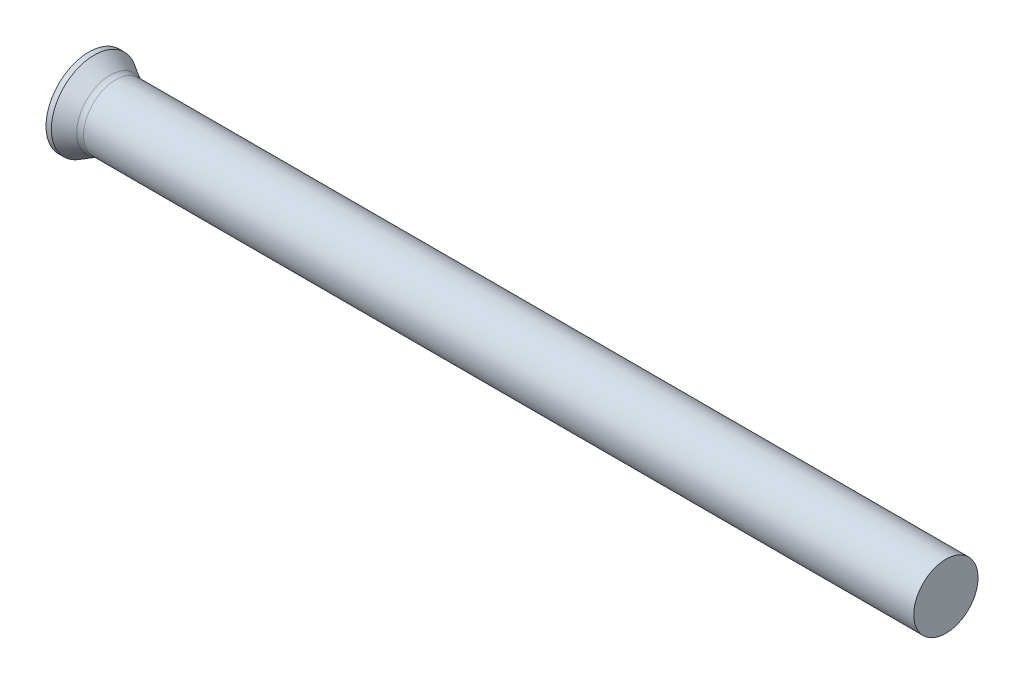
ISO-10303-21;
HEADER;
FILE_DESCRIPTION(('STEP AP214'),'2;1');
FILE_NAME('part.step','',(''),(''),'','','');
FILE_SCHEMA(('AUTOMOTIVE_DESIGN { 1 0 10303 214 1 1 1 1 }'));
ENDSEC;
DATA;
#1=APPLICATION_CONTEXT('core data for automotive mechanical design processes');
#2=APPLICATION_PROTOCOL_DEFINITION('international standard','automotive_design',2000,#1);
#3=PRODUCT_CONTEXT('',#1,'mechanical');
#4=PRODUCT('Part','Part','',(#3));
#5=PRODUCT_RELATED_PRODUCT_CATEGORY('part','',(#4));
#6=PRODUCT_DEFINITION_FORMATION('','',#4);
#7=PRODUCT_DEFINITION_CONTEXT('part definition',#1,'design');
#8=PRODUCT_DEFINITION('design','',#6,#7);
#9=PRODUCT_DEFINITION_SHAPE('','',#8);
#10=(LENGTH_UNIT() NAMED_UNIT(*) SI_UNIT(.MILLI.,.METRE.));
#11=(NAMED_UNIT(*) PLANE_ANGLE_UNIT() SI_UNIT($,.RADIAN.));
#12=(NAMED_UNIT(*) SI_UNIT($,.STERADIAN.) SOLID_ANGLE_UNIT());
#13=UNCERTAINTY_MEASURE_WITH_UNIT(LENGTH_MEASURE(1.E-05),#10,'distance_accuracy_value','');
#14=(GEOMETRIC_REPRESENTATION_CONTEXT(3) GLOBAL_UNCERTAINTY_ASSIGNED_CONTEXT((#13)) GLOBAL_UNIT_ASSIGNED_CONTEXT((#10,
#11,#12)) REPRESENTATION_CONTEXT('',''));
#15=CARTESIAN_POINT('',(0.,0.,0.));
#16=DIRECTION('',(0.,0.,1.));
#17=DIRECTION('',(1.,0.,0.));
#18=AXIS2_PLACEMENT_3D('',#15,#16,#17);
#19=CARTESIAN_POINT('',(0.,0.,0.));
#20=DIRECTION('',(1.,0.,0.));
#21=DIRECTION('',(0.,0.,-1.));
#22=AXIS2_PLACEMENT_3D('',#19,#20,#21);
#23=PLANE('',#22);
#24=CARTESIAN_POINT('',(0.,0.,0.));
#25=DIRECTION('',(-1.,0.,0.));
#26=DIRECTION('',(0.,0.,1.));
#27=AXIS2_PLACEMENT_3D('',#24,#25,#26);
#28=CIRCLE('',#27,4.);
#29=CARTESIAN_POINT('',(0.,0.,4.));
#30=VERTEX_POINT('',#29);
#31=EDGE_CURVE('E25',#30,#30,#28,.T.);
#32=ORIENTED_EDGE('',*,*,#31,.T.);
#33=EDGE_LOOP('',(#32));
#34=FACE_BOUND('',#33,.T.);
#35=ADVANCED_FACE('F14',(#34),#23,.F.);
#36=CARTESIAN_POINT('',(0.,0.,0.));
#37=DIRECTION('',(-1.,0.,0.));
#38=DIRECTION('',(0.,0.,1.));
#39=AXIS2_PLACEMENT_3D('',#36,#37,#38);
#40=CYLINDRICAL_SURFACE('',#39,4.);
#41=ORIENTED_EDGE('',*,*,#31,.F.);
#42=EDGE_LOOP('',(#41));
#43=FACE_BOUND('',#42,.T.);
#44=CARTESIAN_POINT('',(0.497949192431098,0.,0.));
#45=DIRECTION('',(-1.,0.,0.));
#46=DIRECTION('',(0.,0.,1.));
#47=AXIS2_PLACEMENT_3D('',#44,#45,#46);
#48=CIRCLE('',#47,4.);
#49=CARTESIAN_POINT('',(0.497949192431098,0.,4.));
#50=VERTEX_POINT('',#49);
#51=EDGE_CURVE('E29',#50,#50,#48,.T.);
#52=ORIENTED_EDGE('',*,*,#51,.T.);
#53=EDGE_LOOP('',(#52));
#54=FACE_BOUND('',#53,.T.);
#55=ADVANCED_FACE('F53',(#43,#54),#40,.T.);
#56=CARTESIAN_POINT('',(2.23,0.,0.));
#57=DIRECTION('',(-1.,0.,0.));
#58=DIRECTION('',(0.,0.,1.));
#59=AXIS2_PLACEMENT_3D('',#56,#57,#58);
#60=CONICAL_SURFACE('',#59,3.,0.523598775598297);
#61=CARTESIAN_POINT('',(1.99794919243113,0.,0.));
#62=DIRECTION('',(-1.,0.,0.));
#63=DIRECTION('',(0.,0.,1.));
#64=AXIS2_PLACEMENT_3D('',#61,#62,#63);
#65=CIRCLE('',#64,3.13397459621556);
#66=CARTESIAN_POINT('',(1.99794919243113,0.,3.13397459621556));
#67=VERTEX_POINT('',#66);
#68=EDGE_CURVE('E21',#67,#67,#65,.T.);
#69=ORIENTED_EDGE('',*,*,#68,.T.);
#70=EDGE_LOOP('',(#69));
#71=FACE_BOUND('',#70,.T.);
#72=ORIENTED_EDGE('',*,*,#51,.F.);
#73=EDGE_LOOP('',(#72));
#74=FACE_BOUND('',#73,.T.);
#75=ADVANCED_FACE('F50',(#71,#74),#60,.T.);
#76=CARTESIAN_POINT('',(0.,0.,0.));
#77=DIRECTION('',(-1.,0.,0.));
#78=DIRECTION('',(0.,0.,1.));
#79=AXIS2_PLACEMENT_3D('',#76,#77,#78);
#80=CYLINDRICAL_SURFACE('',#79,3.);
#81=CARTESIAN_POINT('',(2.49794919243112,0.,0.));
#82=DIRECTION('',(-1.,0.,0.));
#83=DIRECTION('',(0.,0.,1.));
#84=AXIS2_PLACEMENT_3D('',#81,#82,#83);
#85=CIRCLE('',#84,3.);
#86=CARTESIAN_POINT('',(2.49794919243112,0.,3.));
#87=VERTEX_POINT('',#86);
#88=EDGE_CURVE('E9',#87,#87,#85,.F.);
#89=ORIENTED_EDGE('',*,*,#88,.T.);
#90=EDGE_LOOP('',(#89));
#91=FACE_BOUND('',#90,.T.);
#92=CARTESIAN_POINT('',(80.,0.,0.));
#93=DIRECTION('',(-1.,0.,0.));
#94=DIRECTION('',(0.,0.,1.));
#95=AXIS2_PLACEMENT_3D('',#92,#93,#94);
#96=CIRCLE('',#95,3.);
#97=CARTESIAN_POINT('',(80.,0.,3.));
#98=VERTEX_POINT('',#97);
#99=EDGE_CURVE('E34',#98,#98,#96,.T.);
#100=ORIENTED_EDGE('',*,*,#99,.T.);
#101=EDGE_LOOP('',(#100));
#102=FACE_BOUND('',#101,.T.);
#103=ADVANCED_FACE('F38',(#91,#102),#80,.T.);
#104=CARTESIAN_POINT('',(80.,3.,0.));
#105=DIRECTION('',(-1.,0.,0.));
#106=DIRECTION('',(0.,0.,1.));
#107=AXIS2_PLACEMENT_3D('',#104,#105,#106);
#108=PLANE('',#107);
#109=ORIENTED_EDGE('',*,*,#99,.F.);
#110=EDGE_LOOP('',(#109));
#111=FACE_BOUND('',#110,.T.);
#112=ADVANCED_FACE('F40',(#111),#108,.F.);
#113=CARTESIAN_POINT('',(2.49794919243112,0.,0.));
#114=DIRECTION('',(-1.,0.,0.));
#115=DIRECTION('',(0.,0.,1.));
#116=AXIS2_PLACEMENT_3D('',#113,#114,#115);
#117=TOROIDAL_SURFACE('',#116,4.,1.);
#118=ORIENTED_EDGE('',*,*,#88,.F.);
#119=EDGE_LOOP('',(#118));
#120=FACE_BOUND('',#119,.T.);
#121=ORIENTED_EDGE('',*,*,#68,.F.);
#122=EDGE_LOOP('',(#121));
#123=FACE_BOUND('',#122,.T.);
#124=ADVANCED_FACE('F16',(#120,#123),#117,.F.);
#125=CLOSED_SHELL('',(#35,#55,#75,#103,#112,#124));
#126=MANIFOLD_SOLID_BREP('B1',#125);
#127=ADVANCED_BREP_SHAPE_REPRESENTATION('',(#18,#126),#14);
#128=SHAPE_DEFINITION_REPRESENTATION(#9,#127);
ENDSEC;
END-ISO-10303-21;
